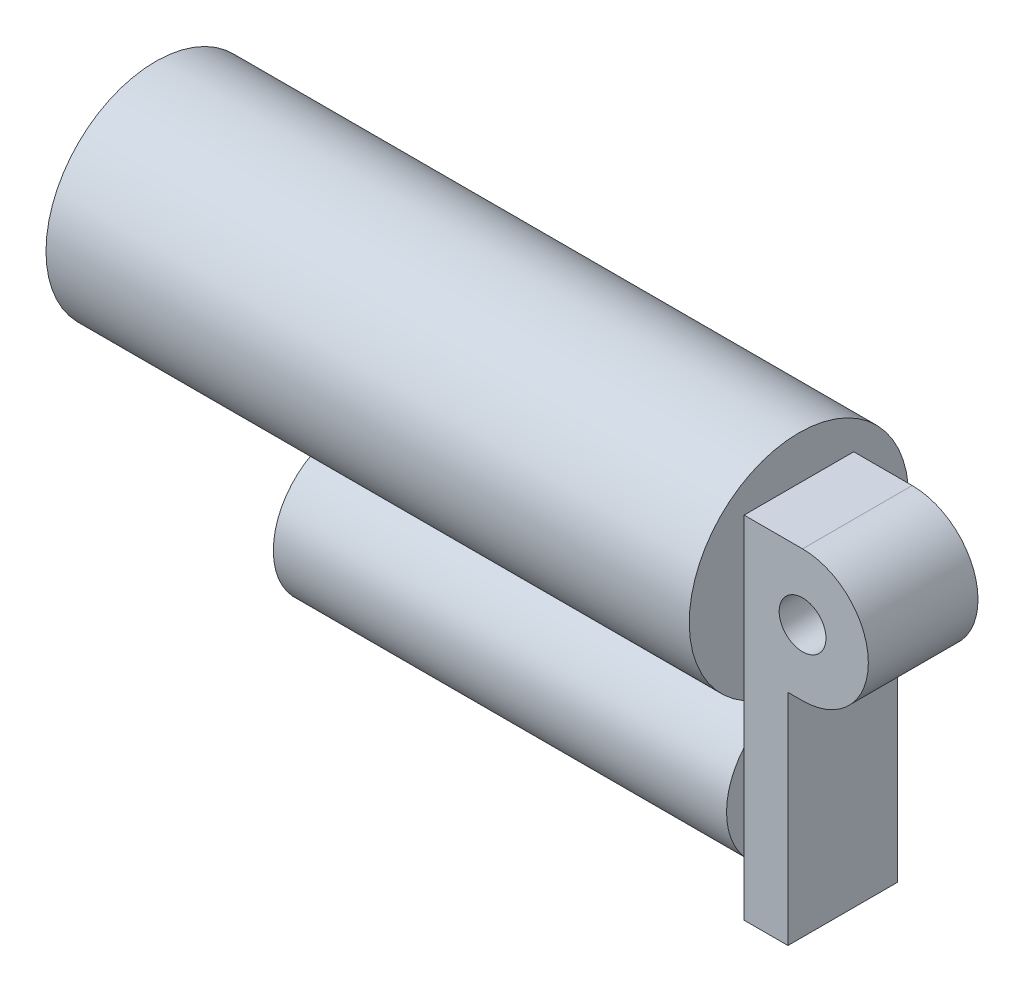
ISO-10303-21;
HEADER;
FILE_DESCRIPTION(('STEP AP214'),'2;1');
FILE_NAME('part.step','',(''),(''),'','','');
FILE_SCHEMA(('AUTOMOTIVE_DESIGN { 1 0 10303 214 1 1 1 1 }'));
ENDSEC;
DATA;
#1=APPLICATION_CONTEXT('core data for automotive mechanical design processes');
#2=APPLICATION_PROTOCOL_DEFINITION('international standard','automotive_design',2000,#1);
#3=PRODUCT_CONTEXT('',#1,'mechanical');
#4=PRODUCT('Part','Part','',(#3));
#5=PRODUCT_RELATED_PRODUCT_CATEGORY('part','',(#4));
#6=PRODUCT_DEFINITION_FORMATION('','',#4);
#7=PRODUCT_DEFINITION_CONTEXT('part definition',#1,'design');
#8=PRODUCT_DEFINITION('design','',#6,#7);
#9=PRODUCT_DEFINITION_SHAPE('','',#8);
#10=(LENGTH_UNIT() NAMED_UNIT(*) SI_UNIT(.MILLI.,.METRE.));
#11=(NAMED_UNIT(*) PLANE_ANGLE_UNIT() SI_UNIT($,.RADIAN.));
#12=(NAMED_UNIT(*) SI_UNIT($,.STERADIAN.) SOLID_ANGLE_UNIT());
#13=UNCERTAINTY_MEASURE_WITH_UNIT(LENGTH_MEASURE(1.E-05),#10,'distance_accuracy_value','');
#14=(GEOMETRIC_REPRESENTATION_CONTEXT(3) GLOBAL_UNCERTAINTY_ASSIGNED_CONTEXT((#13)) GLOBAL_UNIT_ASSIGNED_CONTEXT((#10,
#11,#12)) REPRESENTATION_CONTEXT('',''));
#15=CARTESIAN_POINT('',(0.,0.,0.));
#16=DIRECTION('',(0.,0.,1.));
#17=DIRECTION('',(1.,0.,0.));
#18=AXIS2_PLACEMENT_3D('',#15,#16,#17);
#19=CARTESIAN_POINT('',(-48.,-12.5,0.));
#20=DIRECTION('',(1.,0.,0.));
#21=DIRECTION('',(0.,0.,-1.));
#22=AXIS2_PLACEMENT_3D('',#19,#20,#21);
#23=CYLINDRICAL_SURFACE('',#22,4.95);
#24=CARTESIAN_POINT('',(-4.,-12.5,0.));
#25=DIRECTION('',(-1.,0.,0.));
#26=DIRECTION('',(0.,0.,1.));
#27=AXIS2_PLACEMENT_3D('',#24,#25,#26);
#28=CIRCLE('',#27,4.95);
#29=CARTESIAN_POINT('',(-4.,-9.2689011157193,3.75));
#30=VERTEX_POINT('',#29);
#31=CARTESIAN_POINT('',(-4.,-9.2689011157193,-3.75));
#32=VERTEX_POINT('',#31);
#33=EDGE_CURVE('E64',#30,#32,#28,.T.);
#34=ORIENTED_EDGE('',*,*,#33,.T.);
#35=CARTESIAN_POINT('',(-4.,-15.7310988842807,-3.75));
#36=VERTEX_POINT('',#35);
#37=EDGE_CURVE('E131',#32,#36,#28,.T.);
#38=ORIENTED_EDGE('',*,*,#37,.T.);
#39=CARTESIAN_POINT('',(-4.,-12.5,0.));
#40=DIRECTION('',(1.,0.,0.));
#41=DIRECTION('',(0.,0.,-1.));
#42=AXIS2_PLACEMENT_3D('',#39,#40,#41);
#43=CIRCLE('',#42,4.95);
#44=CARTESIAN_POINT('',(-4.,-15.7310988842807,3.75));
#45=VERTEX_POINT('',#44);
#46=EDGE_CURVE('E11',#36,#45,#43,.F.);
#47=ORIENTED_EDGE('',*,*,#46,.T.);
#48=EDGE_CURVE('E134',#45,#30,#28,.T.);
#49=ORIENTED_EDGE('',*,*,#48,.T.);
#50=EDGE_LOOP('',(#34,#38,#47,#49));
#51=FACE_BOUND('',#50,.T.);
#52=CARTESIAN_POINT('',(-35.,-12.5,0.));
#53=DIRECTION('',(-1.,0.,0.));
#54=DIRECTION('',(0.,0.,1.));
#55=AXIS2_PLACEMENT_3D('',#52,#53,#54);
#56=CIRCLE('',#55,4.95);
#57=CARTESIAN_POINT('',(-35.,-12.5,4.95));
#58=VERTEX_POINT('',#57);
#59=EDGE_CURVE('E144',#58,#58,#56,.T.);
#60=ORIENTED_EDGE('',*,*,#59,.F.);
#61=EDGE_LOOP('',(#60));
#62=FACE_BOUND('',#61,.T.);
#63=ADVANCED_FACE('F41',(#51,#62),#23,.T.);
#64=CARTESIAN_POINT('',(-4.,-4.5,3.75));
#65=DIRECTION('',(1.,0.,0.));
#66=DIRECTION('',(0.,0.,-1.));
#67=AXIS2_PLACEMENT_3D('',#64,#65,#66);
#68=PLANE('',#67);
#69=ORIENTED_EDGE('',*,*,#46,.F.);
#70=DIRECTION('',(0.,-1.,0.));
#71=VECTOR('',#70,1.);
#72=CARTESIAN_POINT('',(-4.,-4.5,-3.75));
#73=LINE('',#72,#71);
#74=CARTESIAN_POINT('',(-4.,-19.5,-3.75));
#75=VERTEX_POINT('',#74);
#76=EDGE_CURVE('E128',#36,#75,#73,.T.);
#77=ORIENTED_EDGE('',*,*,#76,.T.);
#78=DIRECTION('',(0.,0.,-1.));
#79=VECTOR('',#78,1.);
#80=CARTESIAN_POINT('',(-4.,-19.5,3.75));
#81=LINE('',#80,#79);
#82=CARTESIAN_POINT('',(-4.,-19.5,3.75));
#83=VERTEX_POINT('',#82);
#84=EDGE_CURVE('E216',#83,#75,#81,.T.);
#85=ORIENTED_EDGE('',*,*,#84,.F.);
#86=DIRECTION('',(0.,-1.,0.));
#87=VECTOR('',#86,1.);
#88=CARTESIAN_POINT('',(-4.,4.5,3.75));
#89=LINE('',#88,#87);
#90=EDGE_CURVE('E56',#45,#83,#89,.T.);
#91=ORIENTED_EDGE('',*,*,#90,.F.);
#92=EDGE_LOOP('',(#69,#77,#85,#91));
#93=FACE_BOUND('',#92,.T.);
#94=ADVANCED_FACE('F150',(#93),#68,.F.);
#95=CARTESIAN_POINT('',(0.,0.,3.75));
#96=DIRECTION('',(0.,0.,-1.));
#97=DIRECTION('',(-1.,0.,0.));
#98=AXIS2_PLACEMENT_3D('',#95,#96,#97);
#99=PLANE('',#98);
#100=CARTESIAN_POINT('',(0.,0.,3.75));
#101=DIRECTION('',(0.,0.,1.));
#102=DIRECTION('',(-1.,0.,0.));
#103=AXIS2_PLACEMENT_3D('',#100,#101,#102);
#104=CIRCLE('',#103,4.5);
#105=CARTESIAN_POINT('',(0.,-4.5,3.75));
#106=VERTEX_POINT('',#105);
#107=CARTESIAN_POINT('',(0.,4.5,3.75));
#108=VERTEX_POINT('',#107);
#109=EDGE_CURVE('E233',#106,#108,#104,.T.);
#110=ORIENTED_EDGE('',*,*,#109,.T.);
#111=DIRECTION('',(-1.,0.,0.));
#112=VECTOR('',#111,1.);
#113=CARTESIAN_POINT('',(0.,4.5,3.75));
#114=LINE('',#113,#112);
#115=CARTESIAN_POINT('',(-4.,4.5,3.75));
#116=VERTEX_POINT('',#115);
#117=EDGE_CURVE('E247',#108,#116,#114,.T.);
#118=ORIENTED_EDGE('',*,*,#117,.T.);
#119=CARTESIAN_POINT('',(-4.,-6.49519052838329,3.75));
#120=VERTEX_POINT('',#119);
#121=EDGE_CURVE('E215',#116,#120,#89,.T.);
#122=ORIENTED_EDGE('',*,*,#121,.T.);
#123=EDGE_CURVE('E246',#120,#30,#89,.T.);
#124=ORIENTED_EDGE('',*,*,#123,.T.);
#125=EDGE_CURVE('E273',#30,#45,#89,.T.);
#126=ORIENTED_EDGE('',*,*,#125,.T.);
#127=ORIENTED_EDGE('',*,*,#90,.T.);
#128=DIRECTION('',(1.,0.,0.));
#129=VECTOR('',#128,1.);
#130=CARTESIAN_POINT('',(-4.,-19.5,3.75));
#131=LINE('',#130,#129);
#132=CARTESIAN_POINT('',(-0.999999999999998,-19.5,3.75));
#133=VERTEX_POINT('',#132);
#134=EDGE_CURVE('E243',#83,#133,#131,.T.);
#135=ORIENTED_EDGE('',*,*,#134,.T.);
#136=DIRECTION('',(0.,1.,0.));
#137=VECTOR('',#136,1.);
#138=CARTESIAN_POINT('',(-1.,-4.5,3.75));
#139=LINE('',#138,#137);
#140=CARTESIAN_POINT('',(-1.,-4.5,3.75));
#141=VERTEX_POINT('',#140);
#142=EDGE_CURVE('E241',#133,#141,#139,.T.);
#143=ORIENTED_EDGE('',*,*,#142,.T.);
#144=DIRECTION('',(1.,0.,0.));
#145=VECTOR('',#144,1.);
#146=CARTESIAN_POINT('',(0.,-4.5,3.75));
#147=LINE('',#146,#145);
#148=EDGE_CURVE('E230',#141,#106,#147,.T.);
#149=ORIENTED_EDGE('',*,*,#148,.T.);
#150=EDGE_LOOP('',(#110,#118,#122,#124,#126,#127,#135,#143,#149));
#151=FACE_BOUND('',#150,.T.);
#152=CARTESIAN_POINT('',(0.,0.,3.75));
#153=DIRECTION('',(0.,0.,1.));
#154=DIRECTION('',(1.,0.,0.));
#155=AXIS2_PLACEMENT_3D('',#152,#153,#154);
#156=CIRCLE('',#155,1.6);
#157=CARTESIAN_POINT('',(1.6,0.,3.75));
#158=VERTEX_POINT('',#157);
#159=EDGE_CURVE('E239',#158,#158,#156,.T.);
#160=ORIENTED_EDGE('',*,*,#159,.F.);
#161=EDGE_LOOP('',(#160));
#162=FACE_BOUND('',#161,.T.);
#163=ADVANCED_FACE('F157',(#151,#162),#99,.F.);
#164=CARTESIAN_POINT('',(0.,0.,-3.75));
#165=DIRECTION('',(0.,0.,-1.));
#166=DIRECTION('',(-1.,0.,0.));
#167=AXIS2_PLACEMENT_3D('',#164,#165,#166);
#168=PLANE('',#167);
#169=CARTESIAN_POINT('',(0.,0.,-3.75));
#170=DIRECTION('',(0.,0.,1.));
#171=DIRECTION('',(-1.,0.,0.));
#172=AXIS2_PLACEMENT_3D('',#169,#170,#171);
#173=CIRCLE('',#172,4.5);
#174=CARTESIAN_POINT('',(0.,-4.5,-3.75));
#175=VERTEX_POINT('',#174);
#176=CARTESIAN_POINT('',(0.,4.5,-3.75));
#177=VERTEX_POINT('',#176);
#178=EDGE_CURVE('E212',#175,#177,#173,.T.);
#179=ORIENTED_EDGE('',*,*,#178,.F.);
#180=DIRECTION('',(1.,0.,0.));
#181=VECTOR('',#180,1.);
#182=CARTESIAN_POINT('',(0.,-4.5,-3.75));
#183=LINE('',#182,#181);
#184=CARTESIAN_POINT('',(-1.,-4.5,-3.75));
#185=VERTEX_POINT('',#184);
#186=EDGE_CURVE('E231',#185,#175,#183,.T.);
#187=ORIENTED_EDGE('',*,*,#186,.F.);
#188=DIRECTION('',(0.,1.,0.));
#189=VECTOR('',#188,1.);
#190=CARTESIAN_POINT('',(-1.,-4.5,-3.75));
#191=LINE('',#190,#189);
#192=CARTESIAN_POINT('',(-0.999999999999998,-19.5,-3.75));
#193=VERTEX_POINT('',#192);
#194=EDGE_CURVE('E234',#193,#185,#191,.T.);
#195=ORIENTED_EDGE('',*,*,#194,.F.);
#196=DIRECTION('',(1.,0.,0.));
#197=VECTOR('',#196,1.);
#198=CARTESIAN_POINT('',(-4.,-19.5,-3.75));
#199=LINE('',#198,#197);
#200=EDGE_CURVE('E236',#75,#193,#199,.T.);
#201=ORIENTED_EDGE('',*,*,#200,.F.);
#202=ORIENTED_EDGE('',*,*,#76,.F.);
#203=EDGE_CURVE('E119',#32,#36,#73,.T.);
#204=ORIENTED_EDGE('',*,*,#203,.F.);
#205=CARTESIAN_POINT('',(-4.,-6.49519052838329,-3.75));
#206=VERTEX_POINT('',#205);
#207=EDGE_CURVE('E111',#206,#32,#73,.T.);
#208=ORIENTED_EDGE('',*,*,#207,.F.);
#209=CARTESIAN_POINT('',(-4.,4.5,-3.75));
#210=VERTEX_POINT('',#209);
#211=EDGE_CURVE('E118',#210,#206,#73,.T.);
#212=ORIENTED_EDGE('',*,*,#211,.F.);
#213=DIRECTION('',(-1.,0.,0.));
#214=VECTOR('',#213,1.);
#215=CARTESIAN_POINT('',(0.,4.5,-3.75));
#216=LINE('',#215,#214);
#217=EDGE_CURVE('E206',#177,#210,#216,.T.);
#218=ORIENTED_EDGE('',*,*,#217,.F.);
#219=EDGE_LOOP('',(#179,#187,#195,#201,#202,#204,#208,#212,#218));
#220=FACE_BOUND('',#219,.T.);
#221=CARTESIAN_POINT('',(0.,0.,-3.75));
#222=DIRECTION('',(0.,0.,1.));
#223=DIRECTION('',(1.,0.,0.));
#224=AXIS2_PLACEMENT_3D('',#221,#222,#223);
#225=CIRCLE('',#224,1.6);
#226=CARTESIAN_POINT('',(1.6,0.,-3.75));
#227=VERTEX_POINT('',#226);
#228=EDGE_CURVE('E251',#227,#227,#225,.T.);
#229=ORIENTED_EDGE('',*,*,#228,.T.);
#230=EDGE_LOOP('',(#229));
#231=FACE_BOUND('',#230,.T.);
#232=ADVANCED_FACE('F125',(#220,#231),#168,.T.);
#233=CARTESIAN_POINT('',(0.,0.,3.75));
#234=DIRECTION('',(0.,0.,-1.));
#235=DIRECTION('',(-1.,0.,0.));
#236=AXIS2_PLACEMENT_3D('',#233,#234,#235);
#237=CYLINDRICAL_SURFACE('',#236,4.5);
#238=ORIENTED_EDGE('',*,*,#178,.T.);
#239=DIRECTION('',(0.,0.,-1.));
#240=VECTOR('',#239,1.);
#241=CARTESIAN_POINT('',(0.,4.5,3.75));
#242=LINE('',#241,#240);
#243=EDGE_CURVE('E49',#108,#177,#242,.T.);
#244=ORIENTED_EDGE('',*,*,#243,.F.);
#245=ORIENTED_EDGE('',*,*,#109,.F.);
#246=DIRECTION('',(0.,0.,-1.));
#247=VECTOR('',#246,1.);
#248=CARTESIAN_POINT('',(0.,-4.5,3.75));
#249=LINE('',#248,#247);
#250=EDGE_CURVE('E227',#106,#175,#249,.T.);
#251=ORIENTED_EDGE('',*,*,#250,.T.);
#252=EDGE_LOOP('',(#238,#244,#245,#251));
#253=FACE_BOUND('',#252,.T.);
#254=ADVANCED_FACE('F43',(#253),#237,.T.);
#255=CARTESIAN_POINT('',(0.,4.5,3.75));
#256=DIRECTION('',(0.,-1.,0.));
#257=DIRECTION('',(1.,0.,0.));
#258=AXIS2_PLACEMENT_3D('',#255,#256,#257);
#259=PLANE('',#258);
#260=ORIENTED_EDGE('',*,*,#217,.T.);
#261=DIRECTION('',(0.,0.,-1.));
#262=VECTOR('',#261,1.);
#263=CARTESIAN_POINT('',(-4.,4.5,3.75));
#264=LINE('',#263,#262);
#265=EDGE_CURVE('E208',#116,#210,#264,.T.);
#266=ORIENTED_EDGE('',*,*,#265,.F.);
#267=ORIENTED_EDGE('',*,*,#117,.F.);
#268=ORIENTED_EDGE('',*,*,#243,.T.);
#269=EDGE_LOOP('',(#260,#266,#267,#268));
#270=FACE_BOUND('',#269,.T.);
#271=ADVANCED_FACE('F196',(#270),#259,.F.);
#272=ORIENTED_EDGE('',*,*,#33,.F.);
#273=ORIENTED_EDGE('',*,*,#123,.F.);
#274=CARTESIAN_POINT('',(-4.,0.,0.));
#275=DIRECTION('',(-1.,0.,0.));
#276=DIRECTION('',(0.,0.,1.));
#277=AXIS2_PLACEMENT_3D('',#274,#275,#276);
#278=CIRCLE('',#277,7.5);
#279=EDGE_CURVE('E115',#206,#120,#278,.T.);
#280=ORIENTED_EDGE('',*,*,#279,.F.);
#281=ORIENTED_EDGE('',*,*,#207,.T.);
#282=EDGE_LOOP('',(#272,#273,#280,#281));
#283=FACE_BOUND('',#282,.T.);
#284=ADVANCED_FACE('F113',(#283),#68,.F.);
#285=CARTESIAN_POINT('',(-4.,-19.5,3.75));
#286=DIRECTION('',(0.,1.,0.));
#287=DIRECTION('',(-1.,0.,0.));
#288=AXIS2_PLACEMENT_3D('',#285,#286,#287);
#289=PLANE('',#288);
#290=ORIENTED_EDGE('',*,*,#200,.T.);
#291=DIRECTION('',(0.,0.,-1.));
#292=VECTOR('',#291,1.);
#293=CARTESIAN_POINT('',(-0.999999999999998,-19.5,3.75));
#294=LINE('',#293,#292);
#295=EDGE_CURVE('E219',#133,#193,#294,.T.);
#296=ORIENTED_EDGE('',*,*,#295,.F.);
#297=ORIENTED_EDGE('',*,*,#134,.F.);
#298=ORIENTED_EDGE('',*,*,#84,.T.);
#299=EDGE_LOOP('',(#290,#296,#297,#298));
#300=FACE_BOUND('',#299,.T.);
#301=ADVANCED_FACE('F191',(#300),#289,.F.);
#302=CARTESIAN_POINT('',(-1.,-4.5,3.75));
#303=DIRECTION('',(-1.,0.,0.));
#304=DIRECTION('',(0.,-1.,0.));
#305=AXIS2_PLACEMENT_3D('',#302,#303,#304);
#306=PLANE('',#305);
#307=ORIENTED_EDGE('',*,*,#194,.T.);
#308=DIRECTION('',(0.,0.,-1.));
#309=VECTOR('',#308,1.);
#310=CARTESIAN_POINT('',(-1.,-4.5,3.75));
#311=LINE('',#310,#309);
#312=EDGE_CURVE('E224',#141,#185,#311,.T.);
#313=ORIENTED_EDGE('',*,*,#312,.F.);
#314=ORIENTED_EDGE('',*,*,#142,.F.);
#315=ORIENTED_EDGE('',*,*,#295,.T.);
#316=EDGE_LOOP('',(#307,#313,#314,#315));
#317=FACE_BOUND('',#316,.T.);
#318=ADVANCED_FACE('F187',(#317),#306,.F.);
#319=CARTESIAN_POINT('',(0.,-4.5,3.75));
#320=DIRECTION('',(0.,1.,0.));
#321=DIRECTION('',(-1.,0.,0.));
#322=AXIS2_PLACEMENT_3D('',#319,#320,#321);
#323=PLANE('',#322);
#324=ORIENTED_EDGE('',*,*,#186,.T.);
#325=ORIENTED_EDGE('',*,*,#250,.F.);
#326=ORIENTED_EDGE('',*,*,#148,.F.);
#327=ORIENTED_EDGE('',*,*,#312,.T.);
#328=EDGE_LOOP('',(#324,#325,#326,#327));
#329=FACE_BOUND('',#328,.T.);
#330=ADVANCED_FACE('F178',(#329),#323,.F.);
#331=CARTESIAN_POINT('',(0.,0.,3.75));
#332=DIRECTION('',(0.,0.,-1.));
#333=DIRECTION('',(-1.,0.,0.));
#334=AXIS2_PLACEMENT_3D('',#331,#332,#333);
#335=CYLINDRICAL_SURFACE('',#334,1.6);
#336=ORIENTED_EDGE('',*,*,#159,.T.);
#337=EDGE_LOOP('',(#336));
#338=FACE_BOUND('',#337,.T.);
#339=ORIENTED_EDGE('',*,*,#228,.F.);
#340=EDGE_LOOP('',(#339));
#341=FACE_BOUND('',#340,.T.);
#342=ADVANCED_FACE('F171',(#338,#341),#335,.F.);
#343=CARTESIAN_POINT('',(-4.,0.,0.));
#344=DIRECTION('',(-1.,0.,0.));
#345=DIRECTION('',(0.,0.,1.));
#346=AXIS2_PLACEMENT_3D('',#343,#344,#345);
#347=PLANE('',#346);
#348=ORIENTED_EDGE('',*,*,#265,.T.);
#349=ORIENTED_EDGE('',*,*,#211,.T.);
#350=EDGE_CURVE('E139',#120,#206,#278,.T.);
#351=ORIENTED_EDGE('',*,*,#350,.F.);
#352=ORIENTED_EDGE('',*,*,#121,.F.);
#353=EDGE_LOOP('',(#348,#349,#351,#352));
#354=FACE_BOUND('',#353,.T.);
#355=ADVANCED_FACE('F168',(#354),#347,.F.);
#356=CARTESIAN_POINT('',(-48.,0.,0.));
#357=DIRECTION('',(1.,0.,0.));
#358=DIRECTION('',(0.,0.,-1.));
#359=AXIS2_PLACEMENT_3D('',#356,#357,#358);
#360=CYLINDRICAL_SURFACE('',#359,7.5);
#361=CARTESIAN_POINT('',(-48.,0.,0.));
#362=DIRECTION('',(-1.,0.,0.));
#363=DIRECTION('',(0.,0.,1.));
#364=AXIS2_PLACEMENT_3D('',#361,#362,#363);
#365=CIRCLE('',#364,7.5);
#366=CARTESIAN_POINT('',(-48.,0.,7.5));
#367=VERTEX_POINT('',#366);
#368=EDGE_CURVE('E254',#367,#367,#365,.T.);
#369=ORIENTED_EDGE('',*,*,#368,.F.);
#370=EDGE_LOOP('',(#369));
#371=FACE_BOUND('',#370,.T.);
#372=ORIENTED_EDGE('',*,*,#279,.T.);
#373=ORIENTED_EDGE('',*,*,#350,.T.);
#374=EDGE_LOOP('',(#372,#373));
#375=FACE_BOUND('',#374,.T.);
#376=ADVANCED_FACE('F166',(#371,#375),#360,.T.);
#377=CARTESIAN_POINT('',(-48.,0.,0.));
#378=DIRECTION('',(-1.,0.,0.));
#379=DIRECTION('',(0.,0.,1.));
#380=AXIS2_PLACEMENT_3D('',#377,#378,#379);
#381=PLANE('',#380);
#382=ORIENTED_EDGE('',*,*,#368,.T.);
#383=EDGE_LOOP('',(#382));
#384=FACE_BOUND('',#383,.T.);
#385=ADVANCED_FACE('F163',(#384),#381,.T.);
#386=CARTESIAN_POINT('',(-4.,-12.5,0.));
#387=DIRECTION('',(-1.,0.,0.));
#388=DIRECTION('',(0.,0.,1.));
#389=AXIS2_PLACEMENT_3D('',#386,#387,#388);
#390=PLANE('',#389);
#391=ORIENTED_EDGE('',*,*,#48,.F.);
#392=ORIENTED_EDGE('',*,*,#125,.F.);
#393=EDGE_LOOP('',(#391,#392));
#394=FACE_BOUND('',#393,.T.);
#395=ADVANCED_FACE('F162',(#394),#390,.F.);
#396=ORIENTED_EDGE('',*,*,#203,.T.);
#397=ORIENTED_EDGE('',*,*,#37,.F.);
#398=EDGE_LOOP('',(#396,#397));
#399=FACE_BOUND('',#398,.T.);
#400=ADVANCED_FACE('F132',(#399),#390,.F.);
#401=CARTESIAN_POINT('',(-35.,-12.5,0.));
#402=DIRECTION('',(-1.,0.,0.));
#403=DIRECTION('',(0.,0.,1.));
#404=AXIS2_PLACEMENT_3D('',#401,#402,#403);
#405=PLANE('',#404);
#406=ORIENTED_EDGE('',*,*,#59,.T.);
#407=EDGE_LOOP('',(#406));
#408=FACE_BOUND('',#407,.T.);
#409=ADVANCED_FACE('F148',(#408),#405,.T.);
#410=CLOSED_SHELL('',(#63,#94,#163,#232,#254,#271,#284,#301,#318,#330,#342,#355,#376,#385,#395,
#400,#409));
#411=MANIFOLD_SOLID_BREP('B2',#410);
#412=ADVANCED_BREP_SHAPE_REPRESENTATION('',(#18,#411),#14);
#413=SHAPE_DEFINITION_REPRESENTATION(#9,#412);
ENDSEC;
END-ISO-10303-21;
